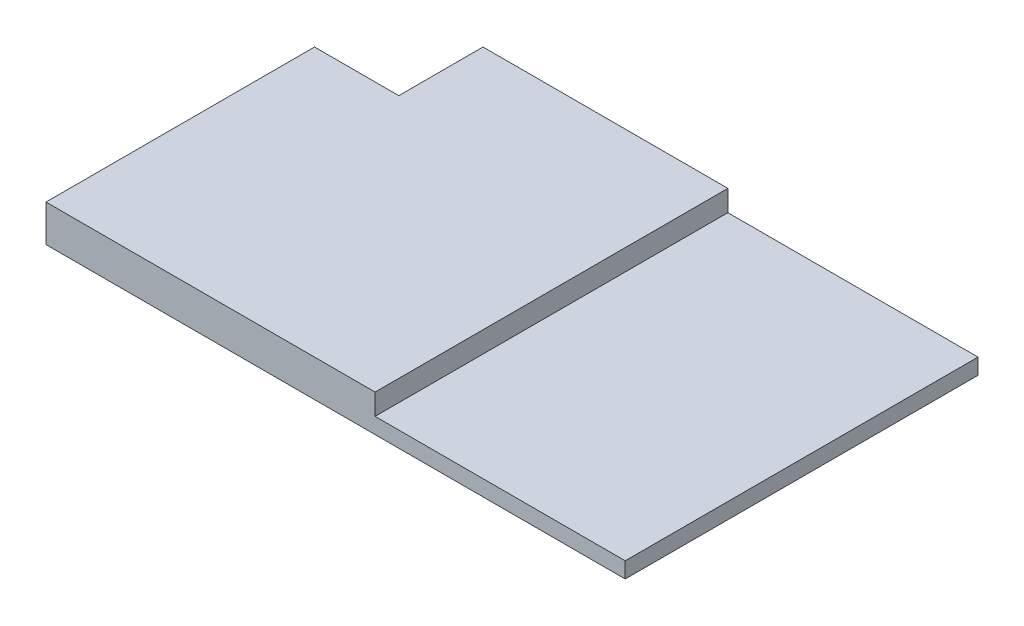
ISO-10303-21;
HEADER;
FILE_DESCRIPTION(('STEP AP214'),'2;1');
FILE_NAME('part.step','',(''),(''),'','','');
FILE_SCHEMA(('AUTOMOTIVE_DESIGN { 1 0 10303 214 1 1 1 1 }'));
ENDSEC;
DATA;
#1=APPLICATION_CONTEXT('core data for automotive mechanical design processes');
#2=APPLICATION_PROTOCOL_DEFINITION('international standard','automotive_design',2000,#1);
#3=PRODUCT_CONTEXT('',#1,'mechanical');
#4=PRODUCT('Part','Part','',(#3));
#5=PRODUCT_RELATED_PRODUCT_CATEGORY('part','',(#4));
#6=PRODUCT_DEFINITION_FORMATION('','',#4);
#7=PRODUCT_DEFINITION_CONTEXT('part definition',#1,'design');
#8=PRODUCT_DEFINITION('design','',#6,#7);
#9=PRODUCT_DEFINITION_SHAPE('','',#8);
#10=(LENGTH_UNIT() NAMED_UNIT(*) SI_UNIT(.MILLI.,.METRE.));
#11=(NAMED_UNIT(*) PLANE_ANGLE_UNIT() SI_UNIT($,.RADIAN.));
#12=(NAMED_UNIT(*) SI_UNIT($,.STERADIAN.) SOLID_ANGLE_UNIT());
#13=UNCERTAINTY_MEASURE_WITH_UNIT(LENGTH_MEASURE(1.E-05),#10,'distance_accuracy_value','');
#14=(GEOMETRIC_REPRESENTATION_CONTEXT(3) GLOBAL_UNCERTAINTY_ASSIGNED_CONTEXT((#13)) GLOBAL_UNIT_ASSIGNED_CONTEXT((#10,
#11,#12)) REPRESENTATION_CONTEXT('',''));
#15=CARTESIAN_POINT('',(0.,0.,0.));
#16=DIRECTION('',(0.,0.,1.));
#17=DIRECTION('',(1.,0.,0.));
#18=AXIS2_PLACEMENT_3D('',#15,#16,#17);
#19=CARTESIAN_POINT('',(0.,0.,0.));
#20=DIRECTION('',(0.,1.,0.));
#21=DIRECTION('',(0.,0.,1.));
#22=AXIS2_PLACEMENT_3D('',#19,#20,#21);
#23=PLANE('',#22);
#24=DIRECTION('',(1.,0.,0.));
#25=VECTOR('',#24,1.);
#26=CARTESIAN_POINT('',(-55.,0.,-17.5));
#27=LINE('',#26,#25);
#28=CARTESIAN_POINT('',(-55.,0.,-17.5));
#29=VERTEX_POINT('',#28);
#30=CARTESIAN_POINT('',(-39.,0.,-17.5));
#31=VERTEX_POINT('',#30);
#32=EDGE_CURVE('E165',#29,#31,#27,.T.);
#33=ORIENTED_EDGE('',*,*,#32,.T.);
#34=DIRECTION('',(0.,0.,-1.));
#35=VECTOR('',#34,1.);
#36=CARTESIAN_POINT('',(-39.,0.,-33.5));
#37=LINE('',#36,#35);
#38=CARTESIAN_POINT('',(-39.,0.,-33.5));
#39=VERTEX_POINT('',#38);
#40=EDGE_CURVE('E168',#31,#39,#37,.T.);
#41=ORIENTED_EDGE('',*,*,#40,.T.);
#42=DIRECTION('',(-1.,0.,0.));
#43=VECTOR('',#42,1.);
#44=CARTESIAN_POINT('',(-55.,0.,-33.5));
#45=LINE('',#44,#43);
#46=CARTESIAN_POINT('',(55.,0.,-33.5));
#47=VERTEX_POINT('',#46);
#48=EDGE_CURVE('E195',#47,#39,#45,.T.);
#49=ORIENTED_EDGE('',*,*,#48,.F.);
#50=DIRECTION('',(0.,0.,-1.));
#51=VECTOR('',#50,1.);
#52=CARTESIAN_POINT('',(55.,0.,-33.5));
#53=LINE('',#52,#51);
#54=CARTESIAN_POINT('',(55.,0.,33.5));
#55=VERTEX_POINT('',#54);
#56=EDGE_CURVE('E180',#55,#47,#53,.T.);
#57=ORIENTED_EDGE('',*,*,#56,.F.);
#58=DIRECTION('',(1.,0.,0.));
#59=VECTOR('',#58,1.);
#60=CARTESIAN_POINT('',(-55.,0.,33.5));
#61=LINE('',#60,#59);
#62=CARTESIAN_POINT('',(-55.,0.,33.5));
#63=VERTEX_POINT('',#62);
#64=EDGE_CURVE('E187',#63,#55,#61,.T.);
#65=ORIENTED_EDGE('',*,*,#64,.F.);
#66=DIRECTION('',(0.,0.,1.));
#67=VECTOR('',#66,1.);
#68=CARTESIAN_POINT('',(-55.,0.,-33.5));
#69=LINE('',#68,#67);
#70=EDGE_CURVE('E198',#29,#63,#69,.T.);
#71=ORIENTED_EDGE('',*,*,#70,.F.);
#72=EDGE_LOOP('',(#33,#41,#49,#57,#65,#71));
#73=FACE_BOUND('',#72,.T.);
#74=DIRECTION('',(0.,0.,-1.));
#75=VECTOR('',#74,1.);
#76=CARTESIAN_POINT('',(-42.9999334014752,0.,4.99999999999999));
#77=LINE('',#76,#75);
#78=CARTESIAN_POINT('',(-42.9999334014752,0.,4.99999999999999));
#79=VERTEX_POINT('',#78);
#80=CARTESIAN_POINT('',(-42.9999334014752,0.,-5.00000000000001));
#81=VERTEX_POINT('',#80);
#82=EDGE_CURVE('E141',#79,#81,#77,.T.);
#83=ORIENTED_EDGE('',*,*,#82,.F.);
#84=DIRECTION('',(-1.,0.,0.));
#85=VECTOR('',#84,1.);
#86=CARTESIAN_POINT('',(-38.,0.,4.99999999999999));
#87=LINE('',#86,#85);
#88=CARTESIAN_POINT('',(-38.,0.,4.99999999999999));
#89=VERTEX_POINT('',#88);
#90=EDGE_CURVE('E138',#89,#79,#87,.T.);
#91=ORIENTED_EDGE('',*,*,#90,.F.);
#92=DIRECTION('',(0.,0.,1.));
#93=VECTOR('',#92,1.);
#94=CARTESIAN_POINT('',(-38.,0.,4.99999999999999));
#95=LINE('',#94,#93);
#96=CARTESIAN_POINT('',(-38.,0.,-5.00000000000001));
#97=VERTEX_POINT('',#96);
#98=EDGE_CURVE('E53',#97,#89,#95,.T.);
#99=ORIENTED_EDGE('',*,*,#98,.F.);
#100=DIRECTION('',(1.,0.,0.));
#101=VECTOR('',#100,1.);
#102=CARTESIAN_POINT('',(-38.,0.,-5.00000000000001));
#103=LINE('',#102,#101);
#104=EDGE_CURVE('E48',#81,#97,#103,.T.);
#105=ORIENTED_EDGE('',*,*,#104,.F.);
#106=EDGE_LOOP('',(#83,#91,#99,#105));
#107=FACE_BOUND('',#106,.T.);
#108=ADVANCED_FACE('F33',(#73,#107),#23,.F.);
#109=CARTESIAN_POINT('',(55.,7.,-33.5));
#110=DIRECTION('',(-1.,0.,0.));
#111=DIRECTION('',(0.,0.,1.));
#112=AXIS2_PLACEMENT_3D('',#109,#110,#111);
#113=PLANE('',#112);
#114=DIRECTION('',(0.,-1.,0.));
#115=VECTOR('',#114,1.);
#116=CARTESIAN_POINT('',(55.,7.,-33.5));
#117=LINE('',#116,#115);
#118=CARTESIAN_POINT('',(55.,3.,-33.5));
#119=VERTEX_POINT('',#118);
#120=EDGE_CURVE('E11',#119,#47,#117,.T.);
#121=ORIENTED_EDGE('',*,*,#120,.F.);
#122=DIRECTION('',(0.,0.,-1.));
#123=VECTOR('',#122,1.);
#124=CARTESIAN_POINT('',(55.,3.,-33.5));
#125=LINE('',#124,#123);
#126=CARTESIAN_POINT('',(55.,3.,33.5));
#127=VERTEX_POINT('',#126);
#128=EDGE_CURVE('E144',#127,#119,#125,.T.);
#129=ORIENTED_EDGE('',*,*,#128,.F.);
#130=DIRECTION('',(0.,-1.,0.));
#131=VECTOR('',#130,1.);
#132=CARTESIAN_POINT('',(55.,7.,33.5));
#133=LINE('',#132,#131);
#134=EDGE_CURVE('E192',#127,#55,#133,.T.);
#135=ORIENTED_EDGE('',*,*,#134,.T.);
#136=ORIENTED_EDGE('',*,*,#56,.T.);
#137=EDGE_LOOP('',(#121,#129,#135,#136));
#138=FACE_BOUND('',#137,.T.);
#139=ADVANCED_FACE('F35',(#138),#113,.F.);
#140=CARTESIAN_POINT('',(-55.,7.,-33.5));
#141=DIRECTION('',(0.,0.,1.));
#142=DIRECTION('',(1.,0.,0.));
#143=AXIS2_PLACEMENT_3D('',#140,#141,#142);
#144=PLANE('',#143);
#145=DIRECTION('',(-1.,0.,0.));
#146=VECTOR('',#145,1.);
#147=CARTESIAN_POINT('',(-55.,7.,-33.5));
#148=LINE('',#147,#146);
#149=CARTESIAN_POINT('',(7.50000000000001,7.,-33.5));
#150=VERTEX_POINT('',#149);
#151=CARTESIAN_POINT('',(-39.,7.,-33.5));
#152=VERTEX_POINT('',#151);
#153=EDGE_CURVE('E184',#150,#152,#148,.T.);
#154=ORIENTED_EDGE('',*,*,#153,.F.);
#155=DIRECTION('',(0.,1.,0.));
#156=VECTOR('',#155,1.);
#157=CARTESIAN_POINT('',(7.50000000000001,3.,-33.5));
#158=LINE('',#157,#156);
#159=CARTESIAN_POINT('',(7.50000000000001,3.,-33.5));
#160=VERTEX_POINT('',#159);
#161=EDGE_CURVE('E158',#160,#150,#158,.T.);
#162=ORIENTED_EDGE('',*,*,#161,.F.);
#163=DIRECTION('',(-1.,0.,0.));
#164=VECTOR('',#163,1.);
#165=CARTESIAN_POINT('',(55.,3.,-33.5));
#166=LINE('',#165,#164);
#167=EDGE_CURVE('E151',#119,#160,#166,.T.);
#168=ORIENTED_EDGE('',*,*,#167,.F.);
#169=ORIENTED_EDGE('',*,*,#120,.T.);
#170=ORIENTED_EDGE('',*,*,#48,.T.);
#171=DIRECTION('',(0.,1.,0.));
#172=VECTOR('',#171,1.);
#173=CARTESIAN_POINT('',(-39.,0.,-33.5));
#174=LINE('',#173,#172);
#175=EDGE_CURVE('E177',#39,#152,#174,.T.);
#176=ORIENTED_EDGE('',*,*,#175,.T.);
#177=EDGE_LOOP('',(#154,#162,#168,#169,#170,#176));
#178=FACE_BOUND('',#177,.T.);
#179=ADVANCED_FACE('F231',(#178),#144,.F.);
#180=CARTESIAN_POINT('',(-55.,7.,-33.5));
#181=DIRECTION('',(1.,0.,0.));
#182=DIRECTION('',(0.,0.,-1.));
#183=AXIS2_PLACEMENT_3D('',#180,#181,#182);
#184=PLANE('',#183);
#185=DIRECTION('',(0.,0.,1.));
#186=VECTOR('',#185,1.);
#187=CARTESIAN_POINT('',(-55.,7.,-33.5));
#188=LINE('',#187,#186);
#189=CARTESIAN_POINT('',(-55.,7.,-17.5));
#190=VERTEX_POINT('',#189);
#191=CARTESIAN_POINT('',(-55.,7.,33.5));
#192=VERTEX_POINT('',#191);
#193=EDGE_CURVE('E186',#190,#192,#188,.T.);
#194=ORIENTED_EDGE('',*,*,#193,.F.);
#195=DIRECTION('',(0.,1.,0.));
#196=VECTOR('',#195,1.);
#197=CARTESIAN_POINT('',(-55.,0.,-17.5));
#198=LINE('',#197,#196);
#199=EDGE_CURVE('E172',#29,#190,#198,.T.);
#200=ORIENTED_EDGE('',*,*,#199,.F.);
#201=ORIENTED_EDGE('',*,*,#70,.T.);
#202=DIRECTION('',(0.,-1.,0.));
#203=VECTOR('',#202,1.);
#204=CARTESIAN_POINT('',(-55.,7.,33.5));
#205=LINE('',#204,#203);
#206=EDGE_CURVE('E41',#192,#63,#205,.T.);
#207=ORIENTED_EDGE('',*,*,#206,.F.);
#208=EDGE_LOOP('',(#194,#200,#201,#207));
#209=FACE_BOUND('',#208,.T.);
#210=ADVANCED_FACE('F239',(#209),#184,.F.);
#211=CARTESIAN_POINT('',(-55.,7.,33.5));
#212=DIRECTION('',(0.,0.,-1.));
#213=DIRECTION('',(-1.,0.,0.));
#214=AXIS2_PLACEMENT_3D('',#211,#212,#213);
#215=PLANE('',#214);
#216=DIRECTION('',(1.,0.,0.));
#217=VECTOR('',#216,1.);
#218=CARTESIAN_POINT('',(55.,3.,33.5));
#219=LINE('',#218,#217);
#220=CARTESIAN_POINT('',(7.50000000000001,3.,33.5));
#221=VERTEX_POINT('',#220);
#222=EDGE_CURVE('E157',#221,#127,#219,.T.);
#223=ORIENTED_EDGE('',*,*,#222,.F.);
#224=DIRECTION('',(0.,1.,0.));
#225=VECTOR('',#224,1.);
#226=CARTESIAN_POINT('',(7.50000000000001,3.,33.5));
#227=LINE('',#226,#225);
#228=CARTESIAN_POINT('',(7.50000000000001,7.,33.5));
#229=VERTEX_POINT('',#228);
#230=EDGE_CURVE('E160',#221,#229,#227,.T.);
#231=ORIENTED_EDGE('',*,*,#230,.T.);
#232=DIRECTION('',(1.,0.,0.));
#233=VECTOR('',#232,1.);
#234=CARTESIAN_POINT('',(-55.,7.,33.5));
#235=LINE('',#234,#233);
#236=EDGE_CURVE('E189',#192,#229,#235,.T.);
#237=ORIENTED_EDGE('',*,*,#236,.F.);
#238=ORIENTED_EDGE('',*,*,#206,.T.);
#239=ORIENTED_EDGE('',*,*,#64,.T.);
#240=ORIENTED_EDGE('',*,*,#134,.F.);
#241=EDGE_LOOP('',(#223,#231,#237,#238,#239,#240));
#242=FACE_BOUND('',#241,.T.);
#243=ADVANCED_FACE('F208',(#242),#215,.F.);
#244=CARTESIAN_POINT('',(0.,7.,0.));
#245=DIRECTION('',(0.,1.,0.));
#246=DIRECTION('',(0.,0.,1.));
#247=AXIS2_PLACEMENT_3D('',#244,#245,#246);
#248=PLANE('',#247);
#249=DIRECTION('',(0.,0.,1.));
#250=VECTOR('',#249,1.);
#251=CARTESIAN_POINT('',(7.50000000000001,7.,-33.5));
#252=LINE('',#251,#250);
#253=EDGE_CURVE('E142',#150,#229,#252,.T.);
#254=ORIENTED_EDGE('',*,*,#253,.F.);
#255=ORIENTED_EDGE('',*,*,#153,.T.);
#256=DIRECTION('',(0.,0.,-1.));
#257=VECTOR('',#256,1.);
#258=CARTESIAN_POINT('',(-39.,7.,-33.5));
#259=LINE('',#258,#257);
#260=CARTESIAN_POINT('',(-39.,7.,-17.5));
#261=VERTEX_POINT('',#260);
#262=EDGE_CURVE('E169',#261,#152,#259,.T.);
#263=ORIENTED_EDGE('',*,*,#262,.F.);
#264=DIRECTION('',(1.,0.,0.));
#265=VECTOR('',#264,1.);
#266=CARTESIAN_POINT('',(-55.,7.,-17.5));
#267=LINE('',#266,#265);
#268=EDGE_CURVE('E163',#190,#261,#267,.T.);
#269=ORIENTED_EDGE('',*,*,#268,.F.);
#270=ORIENTED_EDGE('',*,*,#193,.T.);
#271=ORIENTED_EDGE('',*,*,#236,.T.);
#272=EDGE_LOOP('',(#254,#255,#263,#269,#270,#271));
#273=FACE_BOUND('',#272,.T.);
#274=ADVANCED_FACE('F228',(#273),#248,.T.);
#275=CARTESIAN_POINT('',(-39.,0.,-33.5));
#276=DIRECTION('',(1.,0.,0.));
#277=DIRECTION('',(0.,0.,-1.));
#278=AXIS2_PLACEMENT_3D('',#275,#276,#277);
#279=PLANE('',#278);
#280=ORIENTED_EDGE('',*,*,#262,.T.);
#281=ORIENTED_EDGE('',*,*,#175,.F.);
#282=ORIENTED_EDGE('',*,*,#40,.F.);
#283=DIRECTION('',(0.,1.,0.));
#284=VECTOR('',#283,1.);
#285=CARTESIAN_POINT('',(-39.,0.,-17.5));
#286=LINE('',#285,#284);
#287=EDGE_CURVE('E181',#31,#261,#286,.T.);
#288=ORIENTED_EDGE('',*,*,#287,.T.);
#289=EDGE_LOOP('',(#280,#281,#282,#288));
#290=FACE_BOUND('',#289,.T.);
#291=ADVANCED_FACE('F233',(#290),#279,.F.);
#292=CARTESIAN_POINT('',(-55.,0.,-17.5));
#293=DIRECTION('',(0.,0.,1.));
#294=DIRECTION('',(1.,0.,0.));
#295=AXIS2_PLACEMENT_3D('',#292,#293,#294);
#296=PLANE('',#295);
#297=ORIENTED_EDGE('',*,*,#268,.T.);
#298=ORIENTED_EDGE('',*,*,#287,.F.);
#299=ORIENTED_EDGE('',*,*,#32,.F.);
#300=ORIENTED_EDGE('',*,*,#199,.T.);
#301=EDGE_LOOP('',(#297,#298,#299,#300));
#302=FACE_BOUND('',#301,.T.);
#303=ADVANCED_FACE('F237',(#302),#296,.F.);
#304=CARTESIAN_POINT('',(7.50000000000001,3.,-33.5));
#305=DIRECTION('',(-1.,0.,0.));
#306=DIRECTION('',(0.,0.,1.));
#307=AXIS2_PLACEMENT_3D('',#304,#305,#306);
#308=PLANE('',#307);
#309=ORIENTED_EDGE('',*,*,#253,.T.);
#310=ORIENTED_EDGE('',*,*,#230,.F.);
#311=DIRECTION('',(0.,0.,1.));
#312=VECTOR('',#311,1.);
#313=CARTESIAN_POINT('',(7.50000000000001,3.,-33.5));
#314=LINE('',#313,#312);
#315=EDGE_CURVE('E154',#160,#221,#314,.T.);
#316=ORIENTED_EDGE('',*,*,#315,.F.);
#317=ORIENTED_EDGE('',*,*,#161,.T.);
#318=EDGE_LOOP('',(#309,#310,#316,#317));
#319=FACE_BOUND('',#318,.T.);
#320=ADVANCED_FACE('F224',(#319),#308,.F.);
#321=CARTESIAN_POINT('',(0.,3.,0.));
#322=DIRECTION('',(0.,-1.,0.));
#323=DIRECTION('',(0.,0.,-1.));
#324=AXIS2_PLACEMENT_3D('',#321,#322,#323);
#325=PLANE('',#324);
#326=ORIENTED_EDGE('',*,*,#128,.T.);
#327=ORIENTED_EDGE('',*,*,#167,.T.);
#328=ORIENTED_EDGE('',*,*,#315,.T.);
#329=ORIENTED_EDGE('',*,*,#222,.T.);
#330=EDGE_LOOP('',(#326,#327,#328,#329));
#331=FACE_BOUND('',#330,.T.);
#332=ADVANCED_FACE('F220',(#331),#325,.F.);
#333=CARTESIAN_POINT('',(-42.9999334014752,-5.,4.99999999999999));
#334=DIRECTION('',(1.,0.,0.));
#335=DIRECTION('',(0.,0.,-1.));
#336=AXIS2_PLACEMENT_3D('',#333,#334,#335);
#337=PLANE('',#336);
#338=ORIENTED_EDGE('',*,*,#82,.T.);
#339=DIRECTION('',(0.,1.,0.));
#340=VECTOR('',#339,1.);
#341=CARTESIAN_POINT('',(-42.9999334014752,-5.,-5.00000000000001));
#342=LINE('',#341,#340);
#343=CARTESIAN_POINT('',(-42.9999334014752,-5.,-5.00000000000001));
#344=VERTEX_POINT('',#343);
#345=EDGE_CURVE('E122',#344,#81,#342,.T.);
#346=ORIENTED_EDGE('',*,*,#345,.F.);
#347=DIRECTION('',(0.,0.,-1.));
#348=VECTOR('',#347,1.);
#349=CARTESIAN_POINT('',(-42.9999334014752,-5.,4.99999999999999));
#350=LINE('',#349,#348);
#351=CARTESIAN_POINT('',(-42.9999334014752,-5.,4.99999999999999));
#352=VERTEX_POINT('',#351);
#353=EDGE_CURVE('E129',#352,#344,#350,.T.);
#354=ORIENTED_EDGE('',*,*,#353,.F.);
#355=DIRECTION('',(0.,1.,0.));
#356=VECTOR('',#355,1.);
#357=CARTESIAN_POINT('',(-42.9999334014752,-5.,4.99999999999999));
#358=LINE('',#357,#356);
#359=EDGE_CURVE('E364',#352,#79,#358,.T.);
#360=ORIENTED_EDGE('',*,*,#359,.T.);
#361=EDGE_LOOP('',(#338,#346,#354,#360));
#362=FACE_BOUND('',#361,.T.);
#363=ADVANCED_FACE('F140',(#362),#337,.F.);
#364=CARTESIAN_POINT('',(-38.,-5.,-5.00000000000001));
#365=DIRECTION('',(0.,0.,1.));
#366=DIRECTION('',(1.,0.,0.));
#367=AXIS2_PLACEMENT_3D('',#364,#365,#366);
#368=PLANE('',#367);
#369=ORIENTED_EDGE('',*,*,#104,.T.);
#370=DIRECTION('',(0.,1.,0.));
#371=VECTOR('',#370,1.);
#372=CARTESIAN_POINT('',(-38.,-5.,-5.00000000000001));
#373=LINE('',#372,#371);
#374=CARTESIAN_POINT('',(-38.,-5.,-5.00000000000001));
#375=VERTEX_POINT('',#374);
#376=EDGE_CURVE('E125',#375,#97,#373,.T.);
#377=ORIENTED_EDGE('',*,*,#376,.F.);
#378=DIRECTION('',(1.,0.,0.));
#379=VECTOR('',#378,1.);
#380=CARTESIAN_POINT('',(-38.,-5.,-5.00000000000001));
#381=LINE('',#380,#379);
#382=EDGE_CURVE('E118',#344,#375,#381,.T.);
#383=ORIENTED_EDGE('',*,*,#382,.F.);
#384=ORIENTED_EDGE('',*,*,#345,.T.);
#385=EDGE_LOOP('',(#369,#377,#383,#384));
#386=FACE_BOUND('',#385,.T.);
#387=ADVANCED_FACE('F120',(#386),#368,.F.);
#388=CARTESIAN_POINT('',(-38.,-5.,4.99999999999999));
#389=DIRECTION('',(-1.,0.,0.));
#390=DIRECTION('',(0.,0.,1.));
#391=AXIS2_PLACEMENT_3D('',#388,#389,#390);
#392=PLANE('',#391);
#393=ORIENTED_EDGE('',*,*,#98,.T.);
#394=DIRECTION('',(0.,1.,0.));
#395=VECTOR('',#394,1.);
#396=CARTESIAN_POINT('',(-38.,-5.,4.99999999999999));
#397=LINE('',#396,#395);
#398=CARTESIAN_POINT('',(-38.,-5.,4.99999999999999));
#399=VERTEX_POINT('',#398);
#400=EDGE_CURVE('E146',#399,#89,#397,.T.);
#401=ORIENTED_EDGE('',*,*,#400,.F.);
#402=DIRECTION('',(0.,0.,1.));
#403=VECTOR('',#402,1.);
#404=CARTESIAN_POINT('',(-38.,-5.,4.99999999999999));
#405=LINE('',#404,#403);
#406=EDGE_CURVE('E128',#375,#399,#405,.T.);
#407=ORIENTED_EDGE('',*,*,#406,.F.);
#408=ORIENTED_EDGE('',*,*,#376,.T.);
#409=EDGE_LOOP('',(#393,#401,#407,#408));
#410=FACE_BOUND('',#409,.T.);
#411=ADVANCED_FACE('F269',(#410),#392,.F.);
#412=CARTESIAN_POINT('',(-38.,-5.,4.99999999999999));
#413=DIRECTION('',(0.,0.,-1.));
#414=DIRECTION('',(-1.,0.,0.));
#415=AXIS2_PLACEMENT_3D('',#412,#413,#414);
#416=PLANE('',#415);
#417=ORIENTED_EDGE('',*,*,#90,.T.);
#418=ORIENTED_EDGE('',*,*,#359,.F.);
#419=DIRECTION('',(-1.,0.,0.));
#420=VECTOR('',#419,1.);
#421=CARTESIAN_POINT('',(-38.,-5.,4.99999999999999));
#422=LINE('',#421,#420);
#423=EDGE_CURVE('E134',#399,#352,#422,.T.);
#424=ORIENTED_EDGE('',*,*,#423,.F.);
#425=ORIENTED_EDGE('',*,*,#400,.T.);
#426=EDGE_LOOP('',(#417,#418,#424,#425));
#427=FACE_BOUND('',#426,.T.);
#428=ADVANCED_FACE('F272',(#427),#416,.F.);
#429=CARTESIAN_POINT('',(0.,-5.,0.));
#430=DIRECTION('',(0.,1.,0.));
#431=DIRECTION('',(0.,0.,1.));
#432=AXIS2_PLACEMENT_3D('',#429,#430,#431);
#433=PLANE('',#432);
#434=ORIENTED_EDGE('',*,*,#353,.T.);
#435=ORIENTED_EDGE('',*,*,#382,.T.);
#436=ORIENTED_EDGE('',*,*,#406,.T.);
#437=ORIENTED_EDGE('',*,*,#423,.T.);
#438=EDGE_LOOP('',(#434,#435,#436,#437));
#439=FACE_BOUND('',#438,.T.);
#440=ADVANCED_FACE('F132',(#439),#433,.F.);
#441=CLOSED_SHELL('',(#108,#139,#179,#210,#243,#274,#291,#303,#320,#332,#363,#387,#411,#428,#440));
#442=MANIFOLD_SOLID_BREP('B2',#441);
#443=ADVANCED_BREP_SHAPE_REPRESENTATION('',(#18,#442),#14);
#444=SHAPE_DEFINITION_REPRESENTATION(#9,#443);
ENDSEC;
END-ISO-10303-21;
